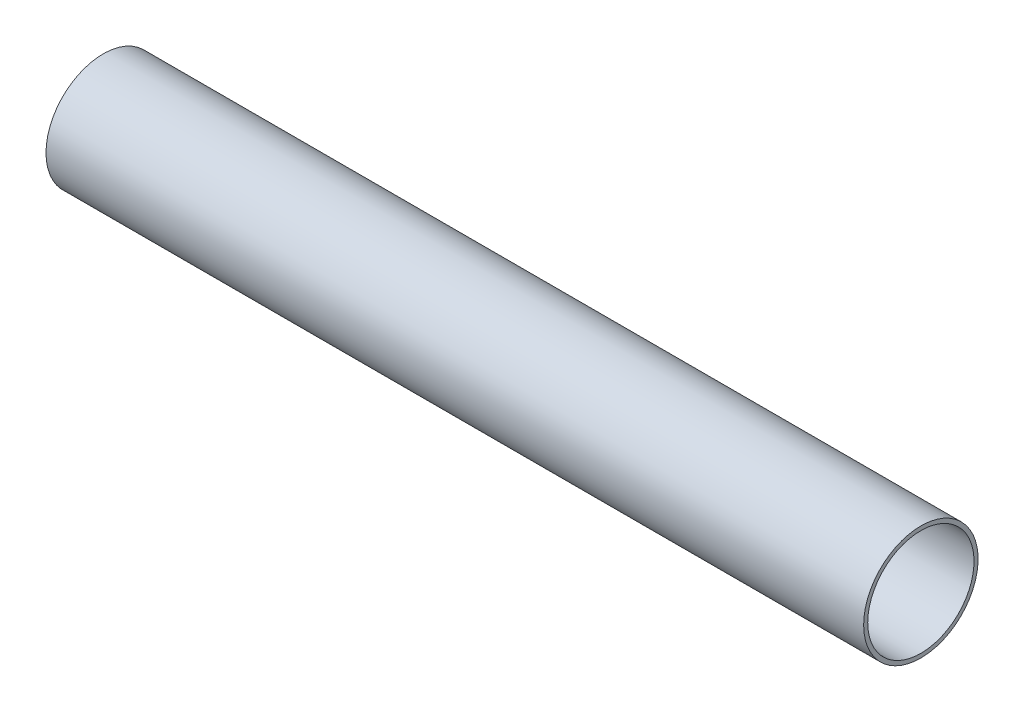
from build123d import *

# Parameters (mm, degrees)
ESQUISSE1_W = 200
ESQUISSE1_H = 1


with BuildPart() as part:
    # Esquisse1 → Base-R_volution (revolve)
    with BuildSketch(Plane.XY, mode=Mode.PRIVATE) as base_r_volution_sk:
        with Locations((100, 13.5)):
            Rectangle(ESQUISSE1_W, ESQUISSE1_H)
    revolve(base_r_volution_sk.sketch.rotate(Axis((0, 0, 0), (1, 0, 0)), 90), axis=Axis((0, 0, 0), (1, 0, 0)))


solid = part.part
